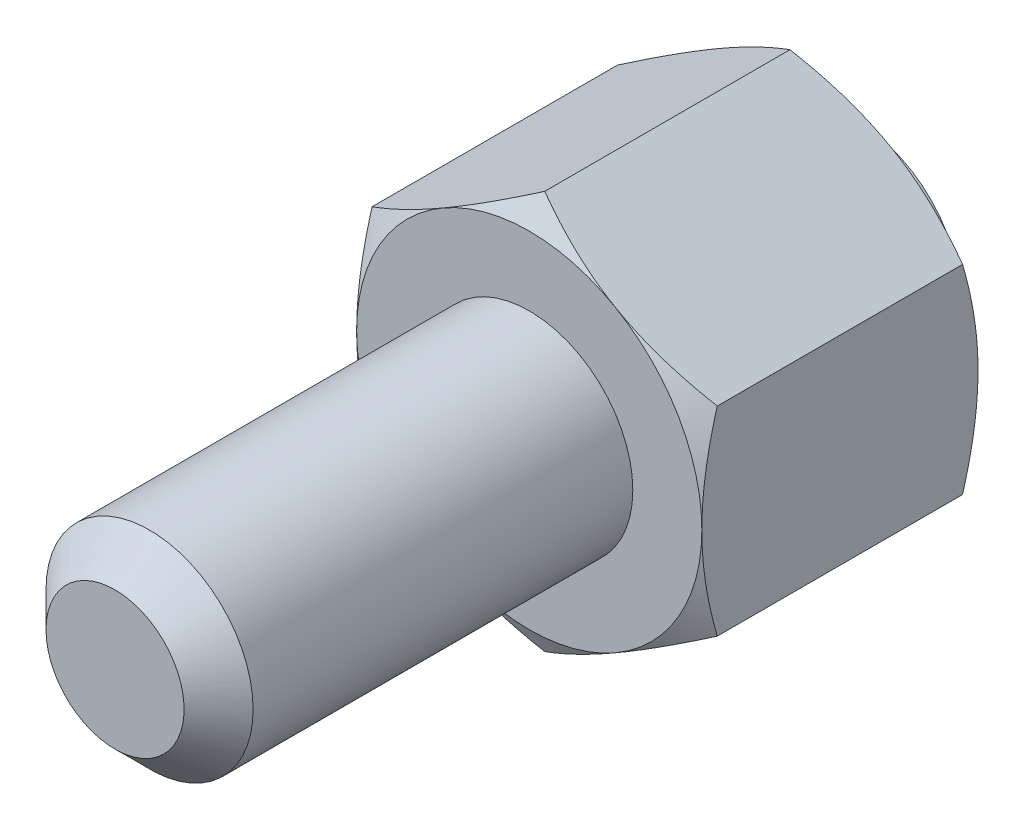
ISO-10303-21;
HEADER;
FILE_DESCRIPTION(('STEP AP214'),'2;1');
FILE_NAME('part.step','',(''),(''),'','','');
FILE_SCHEMA(('AUTOMOTIVE_DESIGN { 1 0 10303 214 1 1 1 1 }'));
ENDSEC;
DATA;
#1=APPLICATION_CONTEXT('core data for automotive mechanical design processes');
#2=APPLICATION_PROTOCOL_DEFINITION('international standard','automotive_design',2000,#1);
#3=PRODUCT_CONTEXT('',#1,'mechanical');
#4=PRODUCT('Part','Part','',(#3));
#5=PRODUCT_RELATED_PRODUCT_CATEGORY('part','',(#4));
#6=PRODUCT_DEFINITION_FORMATION('','',#4);
#7=PRODUCT_DEFINITION_CONTEXT('part definition',#1,'design');
#8=PRODUCT_DEFINITION('design','',#6,#7);
#9=PRODUCT_DEFINITION_SHAPE('','',#8);
#10=(LENGTH_UNIT() NAMED_UNIT(*) SI_UNIT(.MILLI.,.METRE.));
#11=(NAMED_UNIT(*) PLANE_ANGLE_UNIT() SI_UNIT($,.RADIAN.));
#12=(NAMED_UNIT(*) SI_UNIT($,.STERADIAN.) SOLID_ANGLE_UNIT());
#13=UNCERTAINTY_MEASURE_WITH_UNIT(LENGTH_MEASURE(1.E-05),#10,'distance_accuracy_value','');
#14=(GEOMETRIC_REPRESENTATION_CONTEXT(3) GLOBAL_UNCERTAINTY_ASSIGNED_CONTEXT((#13)) GLOBAL_UNIT_ASSIGNED_CONTEXT((#10,
#11,#12)) REPRESENTATION_CONTEXT('',''));
#15=CARTESIAN_POINT('',(0.,0.,0.));
#16=DIRECTION('',(0.,0.,1.));
#17=DIRECTION('',(1.,0.,0.));
#18=AXIS2_PLACEMENT_3D('',#15,#16,#17);
#19=CARTESIAN_POINT('',(0.,-5.77350269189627,11.5));
#20=DIRECTION('',(-0.500000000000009,0.866025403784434,0.));
#21=DIRECTION('',(0.866025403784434,0.500000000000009,0.));
#22=AXIS2_PLACEMENT_3D('',#19,#20,#21);
#23=PLANE('',#22);
#24=CARTESIAN_POINT('',(5.0002,-2.88663587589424,1.94664865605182));
#25=CARTESIAN_POINT('',(4.78046540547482,-3.01349970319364,1.87338656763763));
#26=CARTESIAN_POINT('',(4.55885141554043,-3.14144859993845,1.80675132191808));
#27=CARTESIAN_POINT('',(4.1117860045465,-3.39956193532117,1.6904389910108));
#28=CARTESIAN_POINT('',(3.88632664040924,-3.52973095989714,1.64080304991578));
#29=CARTESIAN_POINT('',(3.43816769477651,-3.78847564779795,1.56355102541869));
#30=CARTESIAN_POINT('',(3.21553790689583,-3.91701101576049,1.53542037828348));
#31=CARTESIAN_POINT('',(2.88081009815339,-4.1102662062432,1.51019492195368));
#32=CARTESIAN_POINT('',(2.76915780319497,-4.17472868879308,1.50461345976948));
#33=CARTESIAN_POINT('',(2.54575002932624,-4.30371322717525,1.49920221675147));
#34=CARTESIAN_POINT('',(2.43399455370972,-4.36823528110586,1.4993722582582));
#35=CARTESIAN_POINT('',(2.12781576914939,-4.54500768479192,1.50775363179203));
#36=CARTESIAN_POINT('',(1.93349391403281,-4.65719946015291,1.52182977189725));
#37=CARTESIAN_POINT('',(1.54613989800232,-4.88083840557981,1.56646525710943));
#38=CARTESIAN_POINT('',(1.35310909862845,-4.9922847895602,1.59703986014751));
#39=CARTESIAN_POINT('',(0.964974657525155,-5.21637431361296,1.67346849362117));
#40=CARTESIAN_POINT('',(0.76992000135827,-5.3289891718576,1.71964637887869));
#41=CARTESIAN_POINT('',(0.38271965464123,-5.55253939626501,1.82445179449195));
#42=CARTESIAN_POINT('',(0.190569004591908,-5.66347762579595,1.88305470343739));
#43=CARTESIAN_POINT('',(-0.000200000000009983,-5.77361816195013,1.94664865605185));
#44=B_SPLINE_CURVE_WITH_KNOTS('',3,(#24,#25,#26,#27,#28,#29,#30,#31,#32,#33,#34,#35,#36,#37,#38,
#39,#40,#41,#42,#43),.UNSPECIFIED.,.F.,.F.,(4,2,2,2,2,2,2,2,2,4),(0.,0.792555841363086,
1.58701660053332,2.36181537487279,2.74884076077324,3.13585419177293,3.80962362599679,
4.48401723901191,5.17336882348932,5.8613669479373),.UNSPECIFIED.);
#45=CARTESIAN_POINT('',(5.,-2.88675134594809,1.94658198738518));
#46=VERTEX_POINT('',#45);
#47=CARTESIAN_POINT('',(2.5,-4.3301270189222,1.5));
#48=VERTEX_POINT('',#47);
#49=EDGE_CURVE('E133',#46,#48,#44,.T.);
#50=ORIENTED_EDGE('',*,*,#49,.F.);
#51=DIRECTION('',(0.,0.,-1.));
#52=VECTOR('',#51,1.);
#53=CARTESIAN_POINT('',(5.,-2.88675134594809,11.5));
#54=LINE('',#53,#52);
#55=CARTESIAN_POINT('',(5.,-2.88675134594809,9.05341801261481));
#56=VERTEX_POINT('',#55);
#57=EDGE_CURVE('E292',#56,#46,#54,.T.);
#58=ORIENTED_EDGE('',*,*,#57,.F.);
#59=CARTESIAN_POINT('',(-0.00019999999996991,-5.77361816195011,9.05335134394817));
#60=CARTESIAN_POINT('',(0.219534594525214,-5.64675433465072,9.12661343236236));
#61=CARTESIAN_POINT('',(0.441148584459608,-5.5188054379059,9.1932486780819));
#62=CARTESIAN_POINT('',(0.888213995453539,-5.26069210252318,9.30956100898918));
#63=CARTESIAN_POINT('',(1.1136733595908,-5.13052307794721,9.35919695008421));
#64=CARTESIAN_POINT('',(1.56183230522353,-4.8717783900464,9.4364489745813));
#65=CARTESIAN_POINT('',(1.78446209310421,-4.74324302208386,9.46457962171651));
#66=CARTESIAN_POINT('',(2.11918990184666,-4.54998783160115,9.48980507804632));
#67=CARTESIAN_POINT('',(2.23084219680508,-4.48552534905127,9.49538654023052));
#68=CARTESIAN_POINT('',(2.45424997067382,-4.35654081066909,9.50079778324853));
#69=CARTESIAN_POINT('',(2.56600544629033,-4.29201875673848,9.5006277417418));
#70=CARTESIAN_POINT('',(2.87218423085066,-4.11524635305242,9.49224636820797));
#71=CARTESIAN_POINT('',(3.06650608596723,-4.00305457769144,9.47817022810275));
#72=CARTESIAN_POINT('',(3.45386010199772,-3.77941563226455,9.43353474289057));
#73=CARTESIAN_POINT('',(3.64689090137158,-3.66796924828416,9.4029601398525));
#74=CARTESIAN_POINT('',(4.03502534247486,-3.44387972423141,9.32653150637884));
#75=CARTESIAN_POINT('',(4.23007999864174,-3.33126486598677,9.28035362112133));
#76=CARTESIAN_POINT('',(4.61728034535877,-3.10771464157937,9.17554820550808));
#77=CARTESIAN_POINT('',(4.80943099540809,-2.99677641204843,9.11694529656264));
#78=CARTESIAN_POINT('',(5.0002,-2.88663587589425,9.05335134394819));
#79=B_SPLINE_CURVE_WITH_KNOTS('',3,(#59,#60,#61,#62,#63,#64,#65,#66,#67,#68,#69,#70,#71,#72,#73,
#74,#75,#76,#77,#78),.UNSPECIFIED.,.F.,.F.,(4,2,2,2,2,2,2,2,2,4),(0.,0.792555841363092,
1.58701660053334,2.36181537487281,2.74884076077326,3.13585419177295,3.8096236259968,
4.48401723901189,5.17336882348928,5.86136694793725),.UNSPECIFIED.);
#80=CARTESIAN_POINT('',(2.50000000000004,-4.33012701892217,9.5));
#81=VERTEX_POINT('',#80);
#82=EDGE_CURVE('E206',#81,#56,#79,.T.);
#83=ORIENTED_EDGE('',*,*,#82,.F.);
#84=CARTESIAN_POINT('',(0.,-5.77350269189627,9.0534180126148));
#85=VERTEX_POINT('',#84);
#86=EDGE_CURVE('E252',#85,#81,#79,.T.);
#87=ORIENTED_EDGE('',*,*,#86,.F.);
#88=DIRECTION('',(0.,0.,-1.));
#89=VECTOR('',#88,1.);
#90=CARTESIAN_POINT('',(0.,-5.77350269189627,11.5));
#91=LINE('',#90,#89);
#92=CARTESIAN_POINT('',(0.,-5.77350269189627,1.94658198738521));
#93=VERTEX_POINT('',#92);
#94=EDGE_CURVE('E287',#85,#93,#91,.T.);
#95=ORIENTED_EDGE('',*,*,#94,.T.);
#96=EDGE_CURVE('E38',#48,#93,#44,.T.);
#97=ORIENTED_EDGE('',*,*,#96,.F.);
#98=EDGE_LOOP('',(#50,#58,#83,#87,#95,#97));
#99=FACE_BOUND('',#98,.T.);
#100=ADVANCED_FACE('F14',(#99),#23,.F.);
#101=CARTESIAN_POINT('',(5.,-2.88675134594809,11.5));
#102=DIRECTION('',(-1.,0.,0.));
#103=DIRECTION('',(0.,0.,-1.));
#104=AXIS2_PLACEMENT_3D('',#101,#102,#103);
#105=PLANE('',#104);
#106=CARTESIAN_POINT('',(5.,-7.70744127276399,3.91748127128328));
#107=CARTESIAN_POINT('',(5.,-7.48944850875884,3.8119239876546));
#108=CARTESIAN_POINT('',(5.,-7.27095027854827,3.70739243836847));
#109=CARTESIAN_POINT('',(5.,-6.83267390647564,3.50095865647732));
#110=CARTESIAN_POINT('',(5.,-6.61289556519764,3.39905684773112));
#111=CARTESIAN_POINT('',(5.,-6.17063500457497,3.19793766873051));
#112=CARTESIAN_POINT('',(5.,-5.94814454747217,3.09873834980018));
#113=CARTESIAN_POINT('',(5.,-5.50137759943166,2.90446216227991));
#114=CARTESIAN_POINT('',(5.,-5.27710119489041,2.80938509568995));
#115=CARTESIAN_POINT('',(5.,-4.81934362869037,2.62154541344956));
#116=CARTESIAN_POINT('',(5.,-4.58579411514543,2.52894844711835));
#117=CARTESIAN_POINT('',(5.,-4.11594543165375,2.35087648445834));
#118=CARTESIAN_POINT('',(5.,-3.87964595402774,2.26540229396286));
#119=CARTESIAN_POINT('',(5.,-3.40437913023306,2.10385408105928));
#120=CARTESIAN_POINT('',(5.,-3.16541846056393,2.02776061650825));
#121=CARTESIAN_POINT('',(5.,-2.68406991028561,1.88744643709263));
#122=CARTESIAN_POINT('',(5.,-2.44168315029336,1.82322193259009));
#123=CARTESIAN_POINT('',(5.,-1.95468423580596,1.7100982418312));
#124=CARTESIAN_POINT('',(5.,-1.71009137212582,1.66111755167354));
#125=CARTESIAN_POINT('',(5.,-1.2179134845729,1.58128125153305));
#126=CARTESIAN_POINT('',(5.,-0.970328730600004,1.5504240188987));
#127=CARTESIAN_POINT('',(5.,-0.476617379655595,1.50970112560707));
#128=CARTESIAN_POINT('',(5.,-0.230513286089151,1.49956934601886));
#129=CARTESIAN_POINT('',(5.,0.26167501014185,1.50045868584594));
#130=CARTESIAN_POINT('',(5.,0.507759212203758,1.51148030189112));
#131=CARTESIAN_POINT('',(5.,0.926943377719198,1.54749890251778));
#132=CARTESIAN_POINT('',(5.,1.10049654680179,1.56751128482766));
#133=CARTESIAN_POINT('',(5.,1.44629389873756,1.61678599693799));
#134=CARTESIAN_POINT('',(5.,1.61853789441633,1.64604962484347));
#135=CARTESIAN_POINT('',(5.,2.13309893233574,1.74617515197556));
#136=CARTESIAN_POINT('',(5.,2.47304427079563,1.82935219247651));
#137=CARTESIAN_POINT('',(5.,2.98128183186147,1.97308911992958));
#138=CARTESIAN_POINT('',(5.,3.15222109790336,2.02481822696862));
#139=CARTESIAN_POINT('',(5.,3.49243829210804,2.1335258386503));
#140=CARTESIAN_POINT('',(5.,3.66171620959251,2.19050437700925));
#141=CARTESIAN_POINT('',(5.,3.99866665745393,2.30880682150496));
#142=CARTESIAN_POINT('',(5.,4.16633972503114,2.37012921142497));
#143=CARTESIAN_POINT('',(5.,4.50030514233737,2.4964102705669));
#144=CARTESIAN_POINT('',(5.,4.66659750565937,2.56136890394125));
#145=CARTESIAN_POINT('',(5.,5.04803367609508,2.71440889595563));
#146=CARTESIAN_POINT('',(5.,5.26275324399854,2.80354544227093));
#147=CARTESIAN_POINT('',(5.,5.69045278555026,2.9859093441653));
#148=CARTESIAN_POINT('',(5.,5.90343266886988,3.07913691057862));
#149=CARTESIAN_POINT('',(5.,6.32795935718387,3.26889080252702));
#150=CARTESIAN_POINT('',(5.,6.53950590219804,3.36541770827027));
#151=CARTESIAN_POINT('',(5.,6.96136313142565,3.56113912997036));
#152=CARTESIAN_POINT('',(5.,7.17167379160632,3.66033369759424));
#153=CARTESIAN_POINT('',(5.,7.80142682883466,3.96134775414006));
#154=CARTESIAN_POINT('',(5.,8.21931083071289,4.16642577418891));
#155=CARTESIAN_POINT('',(5.,9.05210217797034,4.5825381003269));
#156=CARTESIAN_POINT('',(5.,9.46700942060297,4.79357261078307));
#157=CARTESIAN_POINT('',(5.,10.0712479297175,5.10485123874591));
#158=CARTESIAN_POINT('',(5.,10.2614503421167,5.20340928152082));
#159=CARTESIAN_POINT('',(5.,10.6414400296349,5.40131443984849));
#160=CARTESIAN_POINT('',(5.,10.8312273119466,5.50066154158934));
#161=CARTESIAN_POINT('',(5.,11.4000634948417,5.799737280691));
#162=CARTESIAN_POINT('',(5.,11.7785724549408,6.00049297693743));
#163=CARTESIAN_POINT('',(5.,12.5336033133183,6.40364018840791));
#164=CARTESIAN_POINT('',(5.,12.9101277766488,6.6060269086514));
#165=CARTESIAN_POINT('',(5.,13.6622573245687,7.01245675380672));
#166=CARTESIAN_POINT('',(5.,14.0378624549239,7.21649979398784));
#167=CARTESIAN_POINT('',(5.,14.4131258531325,7.42116548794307));
#168=B_SPLINE_CURVE_WITH_KNOTS('',3,(#106,#107,#108,#109,#110,#111,#112,#113,#114,#115,#116,
#117,#118,#119,#120,#121,#122,#123,#124,#125,#126,#127,#128,#129,#130,#131,#132,#133,#134,#135,
#136,#137,#138,#139,#140,#141,#142,#143,#144,#145,#146,#147,#148,#149,#150,#151,#152,#153,#154,
#155,#156,#157,#158,#159,#160,#161,#162,#163,#164,#165,#166,#167),.UNSPECIFIED.,.F.,.F.,(4,2,2,
2,2,2,2,2,2,2,2,2,2,2,2,2,2,2,2,2,2,2,2,2,2,2,2,2,2,2,4),(0.,0.726623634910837,1.45336366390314,
2.18413973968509,2.91488067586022,3.66849919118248,4.42220285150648,5.17431717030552,
5.92619093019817,6.67397270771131,7.42168752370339,8.15973969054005,8.89780918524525,
9.42166361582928,9.9455915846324,10.9940498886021,11.5297908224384,12.0655351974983,
12.6010934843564,13.1366464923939,13.8340490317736,14.5314875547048,15.229049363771,
15.9266246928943,17.3230246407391,18.7194725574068,19.3621341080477,20.0047844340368,
21.2901332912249,22.5725406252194,23.8548827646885),.UNSPECIFIED.);
#169=CARTESIAN_POINT('',(5.,2.88675134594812,1.94658198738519));
#170=VERTEX_POINT('',#169);
#171=CARTESIAN_POINT('',(5.,0.,1.5));
#172=VERTEX_POINT('',#171);
#173=EDGE_CURVE('E313',#170,#172,#168,.F.);
#174=ORIENTED_EDGE('',*,*,#173,.F.);
#175=DIRECTION('',(0.,0.,-1.));
#176=VECTOR('',#175,1.);
#177=CARTESIAN_POINT('',(5.,2.88675134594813,11.5));
#178=LINE('',#177,#176);
#179=CARTESIAN_POINT('',(5.,2.88675134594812,9.05341801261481));
#180=VERTEX_POINT('',#179);
#181=EDGE_CURVE('E284',#180,#170,#178,.T.);
#182=ORIENTED_EDGE('',*,*,#181,.F.);
#183=CARTESIAN_POINT('',(5.,-7.74883329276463,7.06245429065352));
#184=CARTESIAN_POINT('',(5.,-7.53049946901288,7.16834431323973));
#185=CARTESIAN_POINT('',(5.,-7.31166387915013,7.27321749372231));
#186=CARTESIAN_POINT('',(5.,-6.8727223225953,7.4803581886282));
#187=CARTESIAN_POINT('',(5.,-6.65261616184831,7.58262529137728));
#188=CARTESIAN_POINT('',(5.,-6.20972996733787,7.78449751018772));
#189=CARTESIAN_POINT('',(5.,-5.98694189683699,7.88408505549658));
#190=CARTESIAN_POINT('',(5.,-5.53959195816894,8.07917770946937));
#191=CARTESIAN_POINT('',(5.,-5.31503017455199,8.17468301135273));
#192=CARTESIAN_POINT('',(5.,-4.85653860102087,8.36351388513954));
#193=CARTESIAN_POINT('',(5.,-4.62253924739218,8.45667147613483));
#194=CARTESIAN_POINT('',(5.,-4.15180084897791,8.63592319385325));
#195=CARTESIAN_POINT('',(5.,-3.9150614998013,8.72201652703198));
#196=CARTESIAN_POINT('',(5.,-3.43891142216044,8.88487567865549));
#197=CARTESIAN_POINT('',(5.,-3.19950723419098,8.96166042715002));
#198=CARTESIAN_POINT('',(5.,-2.71726462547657,9.1034348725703));
#199=CARTESIAN_POINT('',(5.,-2.47442731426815,9.16842829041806));
#200=CARTESIAN_POINT('',(5.,-1.98653288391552,9.28315054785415));
#201=CARTESIAN_POINT('',(5.,-1.74149561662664,9.33296225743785));
#202=CARTESIAN_POINT('',(5.,-1.24837916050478,9.41450383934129));
#203=CARTESIAN_POINT('',(5.,-1.00030025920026,9.44623540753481));
#204=CARTESIAN_POINT('',(5.,-0.505577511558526,9.48866997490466));
#205=CARTESIAN_POINT('',(5.,-0.25895739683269,9.49964283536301));
#206=CARTESIAN_POINT('',(5.,0.234332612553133,9.50033965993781));
#207=CARTESIAN_POINT('',(5.,0.481002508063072,9.49006322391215));
#208=CARTESIAN_POINT('',(5.,0.899937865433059,9.45529080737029));
#209=CARTESIAN_POINT('',(5.,1.07265207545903,9.43589361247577));
#210=CARTESIAN_POINT('',(5.,1.41680507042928,9.3878920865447));
#211=CARTESIAN_POINT('',(5.,1.58824367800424,9.35928649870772));
#212=CARTESIAN_POINT('',(5.,2.10042470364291,9.26116179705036));
#213=CARTESIAN_POINT('',(5.,2.43883828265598,9.17935298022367));
#214=CARTESIAN_POINT('',(5.,2.94483676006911,9.03763933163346));
#215=CARTESIAN_POINT('',(5.,3.11504848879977,8.98658079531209));
#216=CARTESIAN_POINT('',(5.,3.45381823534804,8.87919651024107));
#217=CARTESIAN_POINT('',(5.,3.62237624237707,8.8228707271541));
#218=CARTESIAN_POINT('',(5.,3.95789251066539,8.70585282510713));
#219=CARTESIAN_POINT('',(5.,4.12485128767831,8.64516217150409));
#220=CARTESIAN_POINT('',(5.,4.45738812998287,8.52012492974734));
#221=CARTESIAN_POINT('',(5.,4.62296621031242,8.45577838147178));
#222=CARTESIAN_POINT('',(5.,5.00898021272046,8.30164185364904));
#223=CARTESIAN_POINT('',(5.,5.22893065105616,8.21063840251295));
#224=CARTESIAN_POINT('',(5.,5.66699461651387,8.02430103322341));
#225=CARTESIAN_POINT('',(5.,5.88510803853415,7.92896686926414));
#226=CARTESIAN_POINT('',(5.,6.31982994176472,7.73482468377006));
#227=CARTESIAN_POINT('',(5.,6.53643812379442,7.63601599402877));
#228=CARTESIAN_POINT('',(5.,6.96835984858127,7.43560426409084));
#229=CARTESIAN_POINT('',(5.,7.18367336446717,7.33400116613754));
#230=CARTESIAN_POINT('',(5.,7.82840184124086,7.02560744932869));
#231=CARTESIAN_POINT('',(5.,8.25619086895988,6.81541977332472));
#232=CARTESIAN_POINT('',(5.,9.10868695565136,6.3888855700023));
#233=CARTESIAN_POINT('',(5.,9.53339390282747,6.17253882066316));
#234=CARTESIAN_POINT('',(5.,10.1513439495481,5.85370074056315));
#235=CARTESIAN_POINT('',(5.,10.3454851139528,5.75294487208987));
#236=CARTESIAN_POINT('',(5.,10.7333432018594,5.55062830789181));
#237=CARTESIAN_POINT('',(5.,10.9270601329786,5.44906762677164));
#238=CARTESIAN_POINT('',(5.,11.5076762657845,5.14333198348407));
#239=CARTESIAN_POINT('',(5.,11.8940250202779,4.93811158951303));
#240=CARTESIAN_POINT('',(5.,12.6646488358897,4.52604252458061));
#241=CARTESIAN_POINT('',(5.,13.048926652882,4.3191989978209));
#242=CARTESIAN_POINT('',(5.,13.8165498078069,3.90383718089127));
#243=CARTESIAN_POINT('',(5.,14.199895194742,3.6953189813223));
#244=CARTESIAN_POINT('',(5.,14.5828959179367,3.48617358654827));
#245=B_SPLINE_CURVE_WITH_KNOTS('',3,(#183,#184,#185,#186,#187,#188,#189,#190,#191,#192,#193,
#194,#195,#196,#197,#198,#199,#200,#201,#202,#203,#204,#205,#206,#207,#208,#209,#210,#211,#212,
#213,#214,#215,#216,#217,#218,#219,#220,#221,#222,#223,#224,#225,#226,#227,#228,#229,#230,#231,
#232,#233,#234,#235,#236,#237,#238,#239,#240,#241,#242,#243,#244),.UNSPECIFIED.,.F.,.F.,(4,2,2,
2,2,2,2,2,2,2,2,2,2,2,2,2,2,2,2,2,2,2,2,2,2,2,2,2,2,2,4),(0.,0.727979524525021,1.45607334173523,
2.18814015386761,2.92017227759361,3.67566755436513,4.43124758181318,5.18526431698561,
5.93904269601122,6.68862964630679,7.43814627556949,8.17785045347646,8.91756856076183,
9.4387156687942,9.95993393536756,11.002952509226,11.5360222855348,12.0690955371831,
12.6019906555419,13.1348799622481,13.8489176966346,14.5629960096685,15.2772124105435,
15.9914435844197,17.4212685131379,18.8511450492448,19.5073316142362,20.1635062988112,
21.475908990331,22.7851347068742,24.0942900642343),.UNSPECIFIED.);
#246=CARTESIAN_POINT('',(5.,0.,9.5));
#247=VERTEX_POINT('',#246);
#248=EDGE_CURVE('E215',#247,#180,#245,.T.);
#249=ORIENTED_EDGE('',*,*,#248,.F.);
#250=EDGE_CURVE('E331',#56,#247,#245,.T.);
#251=ORIENTED_EDGE('',*,*,#250,.F.);
#252=ORIENTED_EDGE('',*,*,#57,.T.);
#253=EDGE_CURVE('E181',#172,#46,#168,.F.);
#254=ORIENTED_EDGE('',*,*,#253,.F.);
#255=EDGE_LOOP('',(#174,#182,#249,#251,#252,#254));
#256=FACE_BOUND('',#255,.T.);
#257=ADVANCED_FACE('F191',(#256),#105,.F.);
#258=CARTESIAN_POINT('',(0.,5.77350269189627,11.5));
#259=DIRECTION('',(0.5,0.866025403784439,0.));
#260=DIRECTION('',(0.866025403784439,-0.5,0.));
#261=AXIS2_PLACEMENT_3D('',#258,#259,#260);
#262=PLANE('',#261);
#263=ORIENTED_EDGE('',*,*,#181,.T.);
#264=CARTESIAN_POINT('',(5.0002,2.88663587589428,1.94664865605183));
#265=CARTESIAN_POINT('',(4.78046540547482,3.01349970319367,1.87338656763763));
#266=CARTESIAN_POINT('',(4.55885141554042,3.14144859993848,1.80675132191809));
#267=CARTESIAN_POINT('',(4.11178600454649,3.3995619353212,1.69043899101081));
#268=CARTESIAN_POINT('',(3.88632664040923,3.52973095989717,1.64080304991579));
#269=CARTESIAN_POINT('',(3.43816769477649,3.78847564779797,1.5635510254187));
#270=CARTESIAN_POINT('',(3.21553790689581,3.91701101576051,1.53542037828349));
#271=CARTESIAN_POINT('',(2.88081009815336,4.11026620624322,1.51019492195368));
#272=CARTESIAN_POINT('',(2.76915780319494,4.1747286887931,1.50461345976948));
#273=CARTESIAN_POINT('',(2.54575002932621,4.30371322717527,1.49920221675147));
#274=CARTESIAN_POINT('',(2.43399455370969,4.36823528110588,1.4993722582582));
#275=CARTESIAN_POINT('',(2.12781576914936,4.54500768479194,1.50775363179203));
#276=CARTESIAN_POINT('',(1.93349391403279,4.65719946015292,1.52182977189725));
#277=CARTESIAN_POINT('',(1.54613989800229,4.88083840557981,1.56646525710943));
#278=CARTESIAN_POINT('',(1.35310909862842,4.9922847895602,1.59703986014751));
#279=CARTESIAN_POINT('',(0.96497465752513,5.21637431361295,1.67346849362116));
#280=CARTESIAN_POINT('',(0.769920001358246,5.32898917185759,1.71964637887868));
#281=CARTESIAN_POINT('',(0.382719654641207,5.55253939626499,1.82445179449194));
#282=CARTESIAN_POINT('',(0.190569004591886,5.66347762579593,1.88305470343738));
#283=CARTESIAN_POINT('',(-0.000200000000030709,5.77361816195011,1.94664865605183));
#284=B_SPLINE_CURVE_WITH_KNOTS('',3,(#264,#265,#266,#267,#268,#269,#270,#271,#272,#273,#274,
#275,#276,#277,#278,#279,#280,#281,#282,#283),.UNSPECIFIED.,.F.,.F.,(4,2,2,2,2,2,2,2,2,4),(0.,
0.792555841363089,1.58701660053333,2.3618153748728,2.74884076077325,3.13585419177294,
3.8096236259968,4.48401723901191,5.17336882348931,5.86136694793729),.UNSPECIFIED.);
#285=CARTESIAN_POINT('',(2.5,4.33012701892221,1.5));
#286=VERTEX_POINT('',#285);
#287=EDGE_CURVE('E134',#170,#286,#284,.T.);
#288=ORIENTED_EDGE('',*,*,#287,.T.);
#289=CARTESIAN_POINT('',(0.,5.77350269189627,1.94658198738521));
#290=VERTEX_POINT('',#289);
#291=EDGE_CURVE('E117',#286,#290,#284,.T.);
#292=ORIENTED_EDGE('',*,*,#291,.T.);
#293=DIRECTION('',(0.,0.,-1.));
#294=VECTOR('',#293,1.);
#295=CARTESIAN_POINT('',(0.,5.77350269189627,11.5));
#296=LINE('',#295,#294);
#297=CARTESIAN_POINT('',(0.,5.77350269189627,9.0534180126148));
#298=VERTEX_POINT('',#297);
#299=EDGE_CURVE('E132',#298,#290,#296,.T.);
#300=ORIENTED_EDGE('',*,*,#299,.F.);
#301=CARTESIAN_POINT('',(-0.000200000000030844,5.77361816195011,9.05335134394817));
#302=CARTESIAN_POINT('',(0.219534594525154,5.64675433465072,9.12661343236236));
#303=CARTESIAN_POINT('',(0.44114858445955,5.51880543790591,9.1932486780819));
#304=CARTESIAN_POINT('',(0.888213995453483,5.26069210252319,9.30956100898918));
#305=CARTESIAN_POINT('',(1.11367335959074,5.13052307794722,9.35919695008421));
#306=CARTESIAN_POINT('',(1.56183230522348,4.87177839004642,9.4364489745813));
#307=CARTESIAN_POINT('',(1.78446209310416,4.74324302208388,9.46457962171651));
#308=CARTESIAN_POINT('',(2.11918990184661,4.54998783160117,9.48980507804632));
#309=CARTESIAN_POINT('',(2.23084219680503,4.48552534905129,9.49538654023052));
#310=CARTESIAN_POINT('',(2.45424997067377,4.35654081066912,9.50079778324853));
#311=CARTESIAN_POINT('',(2.56600544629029,4.29201875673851,9.5006277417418));
#312=CARTESIAN_POINT('',(2.87218423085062,4.11524635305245,9.49224636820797));
#313=CARTESIAN_POINT('',(3.06650608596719,4.00305457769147,9.47817022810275));
#314=CARTESIAN_POINT('',(3.45386010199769,3.77941563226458,9.43353474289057));
#315=CARTESIAN_POINT('',(3.64689090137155,3.66796924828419,9.4029601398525));
#316=CARTESIAN_POINT('',(4.03502534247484,3.44387972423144,9.32653150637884));
#317=CARTESIAN_POINT('',(4.23007999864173,3.3312648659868,9.28035362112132));
#318=CARTESIAN_POINT('',(4.61728034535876,3.1077146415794,9.17554820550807));
#319=CARTESIAN_POINT('',(4.80943099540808,2.99677641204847,9.11694529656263));
#320=CARTESIAN_POINT('',(5.0002,2.88663587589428,9.05335134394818));
#321=B_SPLINE_CURVE_WITH_KNOTS('',3,(#301,#302,#303,#304,#305,#306,#307,#308,#309,#310,#311,
#312,#313,#314,#315,#316,#317,#318,#319,#320),.UNSPECIFIED.,.F.,.F.,(4,2,2,2,2,2,2,2,2,4),(0.,
0.792555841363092,1.58701660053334,2.36181537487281,2.74884076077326,3.13585419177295,
3.8096236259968,4.48401723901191,5.17336882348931,5.86136694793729),.UNSPECIFIED.);
#322=CARTESIAN_POINT('',(2.5,4.33012701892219,9.5));
#323=VERTEX_POINT('',#322);
#324=EDGE_CURVE('E197',#298,#323,#321,.T.);
#325=ORIENTED_EDGE('',*,*,#324,.T.);
#326=EDGE_CURVE('E208',#323,#180,#321,.T.);
#327=ORIENTED_EDGE('',*,*,#326,.T.);
#328=EDGE_LOOP('',(#263,#288,#292,#300,#325,#327));
#329=FACE_BOUND('',#328,.T.);
#330=ADVANCED_FACE('F188',(#329),#262,.T.);
#331=CARTESIAN_POINT('',(0.,5.77350269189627,11.5));
#332=DIRECTION('',(0.500000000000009,-0.866025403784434,0.));
#333=DIRECTION('',(-0.866025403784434,-0.500000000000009,0.));
#334=AXIS2_PLACEMENT_3D('',#331,#332,#333);
#335=PLANE('',#334);
#336=CARTESIAN_POINT('',(-5.0002,2.88663587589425,1.94664865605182));
#337=CARTESIAN_POINT('',(-4.78046540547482,3.01349970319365,1.87338656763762));
#338=CARTESIAN_POINT('',(-4.55885141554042,3.14144859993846,1.80675132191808));
#339=CARTESIAN_POINT('',(-4.11178600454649,3.39956193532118,1.6904389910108));
#340=CARTESIAN_POINT('',(-3.88632664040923,3.52973095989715,1.64080304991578));
#341=CARTESIAN_POINT('',(-3.4381676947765,3.78847564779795,1.56355102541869));
#342=CARTESIAN_POINT('',(-3.21553790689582,3.9170110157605,1.53542037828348));
#343=CARTESIAN_POINT('',(-2.88081009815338,4.1102662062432,1.51019492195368));
#344=CARTESIAN_POINT('',(-2.76915780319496,4.17472868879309,1.50461345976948));
#345=CARTESIAN_POINT('',(-2.54575002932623,4.30371322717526,1.49920221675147));
#346=CARTESIAN_POINT('',(-2.43399455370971,4.36823528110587,1.4993722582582));
#347=CARTESIAN_POINT('',(-2.12781576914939,4.54500768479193,1.50775363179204));
#348=CARTESIAN_POINT('',(-1.93349391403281,4.65719946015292,1.52182977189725));
#349=CARTESIAN_POINT('',(-1.54613989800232,4.88083840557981,1.56646525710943));
#350=CARTESIAN_POINT('',(-1.35310909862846,4.9922847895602,1.59703986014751));
#351=CARTESIAN_POINT('',(-0.964974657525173,5.21637431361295,1.67346849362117));
#352=CARTESIAN_POINT('',(-0.769920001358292,5.32898917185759,1.71964637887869));
#353=CARTESIAN_POINT('',(-0.382719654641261,5.55253939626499,1.82445179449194));
#354=CARTESIAN_POINT('',(-0.190569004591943,5.66347762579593,1.88305470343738));
#355=CARTESIAN_POINT('',(0.00019999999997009,5.77361816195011,1.94664865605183));
#356=B_SPLINE_CURVE_WITH_KNOTS('',3,(#336,#337,#338,#339,#340,#341,#342,#343,#344,#345,#346,
#347,#348,#349,#350,#351,#352,#353,#354,#355),.UNSPECIFIED.,.F.,.F.,(4,2,2,2,2,2,2,2,2,4),(0.,
0.792555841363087,1.58701660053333,2.3618153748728,2.74884076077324,3.13585419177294,
3.80962362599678,4.48401723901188,5.17336882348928,5.86136694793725),.UNSPECIFIED.);
#357=CARTESIAN_POINT('',(-5.,2.8867513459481,1.94658198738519));
#358=VERTEX_POINT('',#357);
#359=CARTESIAN_POINT('',(-2.5,4.3301270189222,1.5));
#360=VERTEX_POINT('',#359);
#361=EDGE_CURVE('E103',#358,#360,#356,.T.);
#362=ORIENTED_EDGE('',*,*,#361,.F.);
#363=DIRECTION('',(0.,0.,-1.));
#364=VECTOR('',#363,1.);
#365=CARTESIAN_POINT('',(-5.,2.8867513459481,11.5));
#366=LINE('',#365,#364);
#367=CARTESIAN_POINT('',(-5.,2.8867513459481,9.05341801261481));
#368=VERTEX_POINT('',#367);
#369=EDGE_CURVE('E277',#368,#358,#366,.T.);
#370=ORIENTED_EDGE('',*,*,#369,.F.);
#371=CARTESIAN_POINT('',(0.00019999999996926,5.77361816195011,9.05335134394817));
#372=CARTESIAN_POINT('',(-0.219534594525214,5.64675433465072,9.12661343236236));
#373=CARTESIAN_POINT('',(-0.441148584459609,5.5188054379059,9.1932486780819));
#374=CARTESIAN_POINT('',(-0.88821399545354,5.26069210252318,9.30956100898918));
#375=CARTESIAN_POINT('',(-1.1136733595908,5.13052307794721,9.35919695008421));
#376=CARTESIAN_POINT('',(-1.56183230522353,4.8717783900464,9.4364489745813));
#377=CARTESIAN_POINT('',(-1.78446209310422,4.74324302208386,9.46457962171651));
#378=CARTESIAN_POINT('',(-2.11918990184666,4.54998783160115,9.48980507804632));
#379=CARTESIAN_POINT('',(-2.23084219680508,4.48552534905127,9.49538654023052));
#380=CARTESIAN_POINT('',(-2.45424997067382,4.35654081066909,9.50079778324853));
#381=CARTESIAN_POINT('',(-2.56600544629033,4.29201875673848,9.5006277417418));
#382=CARTESIAN_POINT('',(-2.87218423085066,4.11524635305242,9.49224636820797));
#383=CARTESIAN_POINT('',(-3.06650608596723,4.00305457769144,9.47817022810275));
#384=CARTESIAN_POINT('',(-3.45386010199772,3.77941563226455,9.43353474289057));
#385=CARTESIAN_POINT('',(-3.64689090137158,3.66796924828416,9.4029601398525));
#386=CARTESIAN_POINT('',(-4.03502534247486,3.44387972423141,9.32653150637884));
#387=CARTESIAN_POINT('',(-4.23007999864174,3.33126486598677,9.28035362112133));
#388=CARTESIAN_POINT('',(-4.61728034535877,3.10771464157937,9.17554820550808));
#389=CARTESIAN_POINT('',(-4.80943099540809,2.99677641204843,9.11694529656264));
#390=CARTESIAN_POINT('',(-5.0002,2.88663587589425,9.05335134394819));
#391=B_SPLINE_CURVE_WITH_KNOTS('',3,(#371,#372,#373,#374,#375,#376,#377,#378,#379,#380,#381,
#382,#383,#384,#385,#386,#387,#388,#389,#390),.UNSPECIFIED.,.F.,.F.,(4,2,2,2,2,2,2,2,2,4),(0.,
0.792555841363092,1.58701660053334,2.36181537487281,2.74884076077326,3.13585419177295,
3.80962362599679,4.48401723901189,5.17336882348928,5.86136694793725),.UNSPECIFIED.);
#392=CARTESIAN_POINT('',(-2.50000000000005,4.33012701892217,9.5));
#393=VERTEX_POINT('',#392);
#394=EDGE_CURVE('E209',#393,#368,#391,.T.);
#395=ORIENTED_EDGE('',*,*,#394,.F.);
#396=EDGE_CURVE('E207',#298,#393,#391,.T.);
#397=ORIENTED_EDGE('',*,*,#396,.F.);
#398=ORIENTED_EDGE('',*,*,#299,.T.);
#399=EDGE_CURVE('E113',#360,#290,#356,.T.);
#400=ORIENTED_EDGE('',*,*,#399,.F.);
#401=EDGE_LOOP('',(#362,#370,#395,#397,#398,#400));
#402=FACE_BOUND('',#401,.T.);
#403=ADVANCED_FACE('F129',(#402),#335,.F.);
#404=CARTESIAN_POINT('',(-5.,-2.88675134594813,11.5));
#405=DIRECTION('',(-1.,0.,0.));
#406=DIRECTION('',(0.,0.,-1.));
#407=AXIS2_PLACEMENT_3D('',#404,#405,#406);
#408=PLANE('',#407);
#409=ORIENTED_EDGE('',*,*,#369,.T.);
#410=CARTESIAN_POINT('',(-5.,-7.70744127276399,3.91748127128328));
#411=CARTESIAN_POINT('',(-5.,-7.48944850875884,3.8119239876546));
#412=CARTESIAN_POINT('',(-5.,-7.27095027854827,3.70739243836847));
#413=CARTESIAN_POINT('',(-5.,-6.83267390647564,3.50095865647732));
#414=CARTESIAN_POINT('',(-5.,-6.61289556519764,3.39905684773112));
#415=CARTESIAN_POINT('',(-5.,-6.17063500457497,3.19793766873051));
#416=CARTESIAN_POINT('',(-5.,-5.94814454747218,3.09873834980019));
#417=CARTESIAN_POINT('',(-5.,-5.50137759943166,2.90446216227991));
#418=CARTESIAN_POINT('',(-5.,-5.27710119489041,2.80938509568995));
#419=CARTESIAN_POINT('',(-5.,-4.81934362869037,2.62154541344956));
#420=CARTESIAN_POINT('',(-5.,-4.58579411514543,2.52894844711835));
#421=CARTESIAN_POINT('',(-5.,-4.11594543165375,2.35087648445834));
#422=CARTESIAN_POINT('',(-5.,-3.87964595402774,2.26540229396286));
#423=CARTESIAN_POINT('',(-5.,-3.40437913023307,2.10385408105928));
#424=CARTESIAN_POINT('',(-5.,-3.16541846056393,2.02776061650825));
#425=CARTESIAN_POINT('',(-5.,-2.68406991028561,1.88744643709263));
#426=CARTESIAN_POINT('',(-5.,-2.44168315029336,1.82322193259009));
#427=CARTESIAN_POINT('',(-5.,-1.95468423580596,1.7100982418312));
#428=CARTESIAN_POINT('',(-5.,-1.71009137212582,1.66111755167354));
#429=CARTESIAN_POINT('',(-5.,-1.2179134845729,1.58128125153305));
#430=CARTESIAN_POINT('',(-5.,-0.970328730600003,1.5504240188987));
#431=CARTESIAN_POINT('',(-5.,-0.476617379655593,1.50970112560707));
#432=CARTESIAN_POINT('',(-5.,-0.23051328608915,1.49956934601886));
#433=CARTESIAN_POINT('',(-5.,0.261675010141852,1.50045868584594));
#434=CARTESIAN_POINT('',(-5.,0.50775921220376,1.51148030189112));
#435=CARTESIAN_POINT('',(-5.,0.926943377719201,1.54749890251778));
#436=CARTESIAN_POINT('',(-5.,1.10049654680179,1.56751128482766));
#437=CARTESIAN_POINT('',(-5.,1.44629389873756,1.61678599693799));
#438=CARTESIAN_POINT('',(-5.,1.61853789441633,1.64604962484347));
#439=CARTESIAN_POINT('',(-5.,2.13309893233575,1.74617515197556));
#440=CARTESIAN_POINT('',(-5.,2.47304427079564,1.82935219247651));
#441=CARTESIAN_POINT('',(-5.,2.98128183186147,1.97308911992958));
#442=CARTESIAN_POINT('',(-5.,3.15222109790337,2.02481822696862));
#443=CARTESIAN_POINT('',(-5.,3.49243829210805,2.1335258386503));
#444=CARTESIAN_POINT('',(-5.,3.66171620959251,2.19050437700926));
#445=CARTESIAN_POINT('',(-5.,3.99866665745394,2.30880682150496));
#446=CARTESIAN_POINT('',(-5.,4.16633972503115,2.37012921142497));
#447=CARTESIAN_POINT('',(-5.,4.50030514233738,2.4964102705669));
#448=CARTESIAN_POINT('',(-5.,4.66659750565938,2.56136890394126));
#449=CARTESIAN_POINT('',(-5.,5.04803367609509,2.71440889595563));
#450=CARTESIAN_POINT('',(-5.,5.26275324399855,2.80354544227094));
#451=CARTESIAN_POINT('',(-5.,5.69045278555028,2.9859093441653));
#452=CARTESIAN_POINT('',(-5.,5.90343266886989,3.07913691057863));
#453=CARTESIAN_POINT('',(-5.,6.32795935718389,3.26889080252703));
#454=CARTESIAN_POINT('',(-5.,6.53950590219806,3.36541770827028));
#455=CARTESIAN_POINT('',(-5.,6.96136313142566,3.56113912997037));
#456=CARTESIAN_POINT('',(-5.,7.17167379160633,3.66033369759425));
#457=CARTESIAN_POINT('',(-5.,7.80142682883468,3.96134775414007));
#458=CARTESIAN_POINT('',(-5.,8.21931083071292,4.16642577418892));
#459=CARTESIAN_POINT('',(-5.,9.05210217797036,4.58253810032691));
#460=CARTESIAN_POINT('',(-5.,9.46700942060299,4.79357261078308));
#461=CARTESIAN_POINT('',(-5.,10.0712479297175,5.10485123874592));
#462=CARTESIAN_POINT('',(-5.,10.2614503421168,5.20340928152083));
#463=CARTESIAN_POINT('',(-5.,10.641440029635,5.4013144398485));
#464=CARTESIAN_POINT('',(-5.,10.8312273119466,5.50066154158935));
#465=CARTESIAN_POINT('',(-5.,11.4000634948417,5.79973728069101));
#466=CARTESIAN_POINT('',(-5.,11.7785724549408,6.00049297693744));
#467=CARTESIAN_POINT('',(-5.,12.5336033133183,6.40364018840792));
#468=CARTESIAN_POINT('',(-5.,12.9101277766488,6.60602690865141));
#469=CARTESIAN_POINT('',(-5.,13.6622573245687,7.01245675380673));
#470=CARTESIAN_POINT('',(-5.,14.0378624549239,7.21649979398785));
#471=CARTESIAN_POINT('',(-5.,14.4131258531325,7.42116548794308));
#472=B_SPLINE_CURVE_WITH_KNOTS('',3,(#410,#411,#412,#413,#414,#415,#416,#417,#418,#419,#420,
#421,#422,#423,#424,#425,#426,#427,#428,#429,#430,#431,#432,#433,#434,#435,#436,#437,#438,#439,
#440,#441,#442,#443,#444,#445,#446,#447,#448,#449,#450,#451,#452,#453,#454,#455,#456,#457,#458,
#459,#460,#461,#462,#463,#464,#465,#466,#467,#468,#469,#470,#471),.UNSPECIFIED.,.F.,.F.,(4,2,2,
2,2,2,2,2,2,2,2,2,2,2,2,2,2,2,2,2,2,2,2,2,2,2,2,2,2,2,4),(0.,0.726623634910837,1.45336366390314,
2.18413973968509,2.91488067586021,3.66849919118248,4.42220285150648,5.17431717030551,
5.92619093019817,6.67397270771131,7.42168752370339,8.15973969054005,8.89780918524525,
9.42166361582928,9.9455915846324,10.9940498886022,11.5297908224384,12.0655351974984,
12.6010934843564,13.1366464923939,13.8340490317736,14.5314875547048,15.229049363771,
15.9266246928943,17.3230246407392,18.7194725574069,19.3621341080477,20.0047844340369,
21.290133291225,22.5725406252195,23.8548827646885),.UNSPECIFIED.);
#473=CARTESIAN_POINT('',(-5.,0.,1.5));
#474=VERTEX_POINT('',#473);
#475=EDGE_CURVE('E107',#358,#474,#472,.F.);
#476=ORIENTED_EDGE('',*,*,#475,.T.);
#477=CARTESIAN_POINT('',(-5.,-2.88675134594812,1.94658198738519));
#478=VERTEX_POINT('',#477);
#479=EDGE_CURVE('E144',#474,#478,#472,.F.);
#480=ORIENTED_EDGE('',*,*,#479,.T.);
#481=DIRECTION('',(0.,0.,-1.));
#482=VECTOR('',#481,1.);
#483=CARTESIAN_POINT('',(-5.,-2.88675134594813,11.5));
#484=LINE('',#483,#482);
#485=CARTESIAN_POINT('',(-5.,-2.88675134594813,9.0534180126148));
#486=VERTEX_POINT('',#485);
#487=EDGE_CURVE('E282',#486,#478,#484,.T.);
#488=ORIENTED_EDGE('',*,*,#487,.F.);
#489=CARTESIAN_POINT('',(-5.,-7.74883329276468,7.0624542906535));
#490=CARTESIAN_POINT('',(-5.,-7.53049946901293,7.1683443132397));
#491=CARTESIAN_POINT('',(-5.,-7.31166387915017,7.27321749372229));
#492=CARTESIAN_POINT('',(-5.,-6.87272232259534,7.48035818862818));
#493=CARTESIAN_POINT('',(-5.,-6.65261616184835,7.58262529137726));
#494=CARTESIAN_POINT('',(-5.,-6.20972996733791,7.7844975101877));
#495=CARTESIAN_POINT('',(-5.,-5.98694189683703,7.88408505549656));
#496=CARTESIAN_POINT('',(-5.,-5.53959195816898,8.07917770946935));
#497=CARTESIAN_POINT('',(-5.,-5.31503017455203,8.17468301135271));
#498=CARTESIAN_POINT('',(-5.,-4.85653860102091,8.36351388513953));
#499=CARTESIAN_POINT('',(-5.,-4.62253924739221,8.45667147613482));
#500=CARTESIAN_POINT('',(-5.,-4.15180084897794,8.63592319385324));
#501=CARTESIAN_POINT('',(-5.,-3.91506149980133,8.72201652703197));
#502=CARTESIAN_POINT('',(-5.,-3.43891142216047,8.88487567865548));
#503=CARTESIAN_POINT('',(-5.,-3.19950723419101,8.96166042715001));
#504=CARTESIAN_POINT('',(-5.,-2.7172646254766,9.1034348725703));
#505=CARTESIAN_POINT('',(-5.,-2.47442731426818,9.16842829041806));
#506=CARTESIAN_POINT('',(-5.,-1.98653288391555,9.28315054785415));
#507=CARTESIAN_POINT('',(-5.,-1.74149561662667,9.33296225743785));
#508=CARTESIAN_POINT('',(-5.,-1.24837916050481,9.41450383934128));
#509=CARTESIAN_POINT('',(-5.,-1.00030025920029,9.44623540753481));
#510=CARTESIAN_POINT('',(-5.,-0.505577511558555,9.48866997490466));
#511=CARTESIAN_POINT('',(-5.,-0.258957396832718,9.49964283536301));
#512=CARTESIAN_POINT('',(-5.,0.234332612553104,9.50033965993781));
#513=CARTESIAN_POINT('',(-5.,0.481002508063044,9.49006322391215));
#514=CARTESIAN_POINT('',(-5.,0.899937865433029,9.45529080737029));
#515=CARTESIAN_POINT('',(-5.,1.072652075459,9.43589361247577));
#516=CARTESIAN_POINT('',(-5.,1.41680507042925,9.3878920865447));
#517=CARTESIAN_POINT('',(-5.,1.58824367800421,9.35928649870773));
#518=CARTESIAN_POINT('',(-5.,2.10042470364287,9.26116179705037));
#519=CARTESIAN_POINT('',(-5.,2.43883828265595,9.17935298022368));
#520=CARTESIAN_POINT('',(-5.,2.94483676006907,9.03763933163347));
#521=CARTESIAN_POINT('',(-5.,3.11504848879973,8.9865807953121));
#522=CARTESIAN_POINT('',(-5.,3.453818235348,8.87919651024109));
#523=CARTESIAN_POINT('',(-5.,3.62237624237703,8.82287072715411));
#524=CARTESIAN_POINT('',(-5.,3.95789251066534,8.70585282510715));
#525=CARTESIAN_POINT('',(-5.,4.12485128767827,8.64516217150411));
#526=CARTESIAN_POINT('',(-5.,4.45738812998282,8.52012492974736));
#527=CARTESIAN_POINT('',(-5.,4.62296621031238,8.4557783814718));
#528=CARTESIAN_POINT('',(-5.,5.00898021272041,8.30164185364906));
#529=CARTESIAN_POINT('',(-5.,5.22893065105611,8.21063840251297));
#530=CARTESIAN_POINT('',(-5.,5.66699461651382,8.02430103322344));
#531=CARTESIAN_POINT('',(-5.,5.8851080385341,7.92896686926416));
#532=CARTESIAN_POINT('',(-5.,6.31982994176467,7.73482468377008));
#533=CARTESIAN_POINT('',(-5.,6.53643812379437,7.63601599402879));
#534=CARTESIAN_POINT('',(-5.,6.96835984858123,7.43560426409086));
#535=CARTESIAN_POINT('',(-5.,7.18367336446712,7.33400116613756));
#536=CARTESIAN_POINT('',(-5.,7.82840184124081,7.02560744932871));
#537=CARTESIAN_POINT('',(-5.,8.25619086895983,6.81541977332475));
#538=CARTESIAN_POINT('',(-5.,9.1086869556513,6.38888557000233));
#539=CARTESIAN_POINT('',(-5.,9.53339390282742,6.17253882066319));
#540=CARTESIAN_POINT('',(-5.,10.1513439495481,5.85370074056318));
#541=CARTESIAN_POINT('',(-5.,10.3454851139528,5.7529448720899));
#542=CARTESIAN_POINT('',(-5.,10.7333432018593,5.55062830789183));
#543=CARTESIAN_POINT('',(-5.,10.9270601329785,5.44906762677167));
#544=CARTESIAN_POINT('',(-5.,11.5076762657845,5.1433319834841));
#545=CARTESIAN_POINT('',(-5.,11.8940250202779,4.93811158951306));
#546=CARTESIAN_POINT('',(-5.,12.6646488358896,4.52604252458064));
#547=CARTESIAN_POINT('',(-5.,13.048926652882,4.31919899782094));
#548=CARTESIAN_POINT('',(-5.,13.8165498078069,3.9038371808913));
#549=CARTESIAN_POINT('',(-5.,14.199895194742,3.69531898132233));
#550=CARTESIAN_POINT('',(-5.,14.5828959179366,3.48617358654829));
#551=B_SPLINE_CURVE_WITH_KNOTS('',3,(#489,#490,#491,#492,#493,#494,#495,#496,#497,#498,#499,
#500,#501,#502,#503,#504,#505,#506,#507,#508,#509,#510,#511,#512,#513,#514,#515,#516,#517,#518,
#519,#520,#521,#522,#523,#524,#525,#526,#527,#528,#529,#530,#531,#532,#533,#534,#535,#536,#537,
#538,#539,#540,#541,#542,#543,#544,#545,#546,#547,#548,#549,#550),.UNSPECIFIED.,.F.,.F.,(4,2,2,
2,2,2,2,2,2,2,2,2,2,2,2,2,2,2,2,2,2,2,2,2,2,2,2,2,2,2,4),(0.,0.727979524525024,1.45607334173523,
2.18814015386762,2.92017227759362,3.67566755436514,4.4312475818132,5.18526431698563,
5.93904269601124,6.68862964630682,7.43814627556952,8.17785045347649,8.91756856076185,
9.43871566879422,9.95993393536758,11.002952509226,11.5360222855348,12.0690955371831,
12.601990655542,13.1348799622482,13.8489176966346,14.5629960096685,15.2772124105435,
15.9914435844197,17.4212685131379,18.8511450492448,19.5073316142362,20.1635062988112,
21.475908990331,22.7851347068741,24.0942900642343),.UNSPECIFIED.);
#552=CARTESIAN_POINT('',(-5.,0.,9.5));
#553=VERTEX_POINT('',#552);
#554=EDGE_CURVE('E245',#486,#553,#551,.T.);
#555=ORIENTED_EDGE('',*,*,#554,.T.);
#556=EDGE_CURVE('E258',#553,#368,#551,.T.);
#557=ORIENTED_EDGE('',*,*,#556,.T.);
#558=EDGE_LOOP('',(#409,#476,#480,#488,#555,#557));
#559=FACE_BOUND('',#558,.T.);
#560=ADVANCED_FACE('F265',(#559),#408,.T.);
#561=CARTESIAN_POINT('',(0.,-5.77350269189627,11.5));
#562=DIRECTION('',(-0.5,-0.866025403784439,0.));
#563=DIRECTION('',(-0.866025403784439,0.5,0.));
#564=AXIS2_PLACEMENT_3D('',#561,#562,#563);
#565=PLANE('',#564);
#566=ORIENTED_EDGE('',*,*,#487,.T.);
#567=CARTESIAN_POINT('',(-5.0002,-2.88663587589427,1.94664865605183));
#568=CARTESIAN_POINT('',(-4.78046540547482,-3.01349970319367,1.87338656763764));
#569=CARTESIAN_POINT('',(-4.55885141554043,-3.14144859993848,1.80675132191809));
#570=CARTESIAN_POINT('',(-4.1117860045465,-3.3995619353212,1.69043899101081));
#571=CARTESIAN_POINT('',(-3.88632664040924,-3.52973095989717,1.64080304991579));
#572=CARTESIAN_POINT('',(-3.4381676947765,-3.78847564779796,1.5635510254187));
#573=CARTESIAN_POINT('',(-3.21553790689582,-3.9170110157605,1.53542037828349));
#574=CARTESIAN_POINT('',(-2.88081009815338,-4.11026620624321,1.51019492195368));
#575=CARTESIAN_POINT('',(-2.76915780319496,-4.17472868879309,1.50461345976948));
#576=CARTESIAN_POINT('',(-2.54575002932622,-4.30371322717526,1.49920221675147));
#577=CARTESIAN_POINT('',(-2.43399455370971,-4.36823528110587,1.4993722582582));
#578=CARTESIAN_POINT('',(-2.12781576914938,-4.54500768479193,1.50775363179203));
#579=CARTESIAN_POINT('',(-1.9334939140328,-4.65719946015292,1.52182977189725));
#580=CARTESIAN_POINT('',(-1.5461398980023,-4.8808384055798,1.56646525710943));
#581=CARTESIAN_POINT('',(-1.35310909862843,-4.9922847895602,1.59703986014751));
#582=CARTESIAN_POINT('',(-0.964974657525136,-5.21637431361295,1.67346849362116));
#583=CARTESIAN_POINT('',(-0.76992000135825,-5.32898917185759,1.71964637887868));
#584=CARTESIAN_POINT('',(-0.382719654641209,-5.55253939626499,1.82445179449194));
#585=CARTESIAN_POINT('',(-0.190569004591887,-5.66347762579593,1.88305470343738));
#586=CARTESIAN_POINT('',(0.00020000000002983,-5.77361816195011,1.94664865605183));
#587=B_SPLINE_CURVE_WITH_KNOTS('',3,(#567,#568,#569,#570,#571,#572,#573,#574,#575,#576,#577,
#578,#579,#580,#581,#582,#583,#584,#585,#586),.UNSPECIFIED.,.F.,.F.,(4,2,2,2,2,2,2,2,2,4),(0.,
0.792555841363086,1.58701660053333,2.36181537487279,2.74884076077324,3.13585419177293,
3.80962362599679,4.4840172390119,5.17336882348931,5.86136694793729),.UNSPECIFIED.);
#588=CARTESIAN_POINT('',(-2.5,-4.33012701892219,1.5));
#589=VERTEX_POINT('',#588);
#590=EDGE_CURVE('E341',#478,#589,#587,.T.);
#591=ORIENTED_EDGE('',*,*,#590,.T.);
#592=EDGE_CURVE('E126',#589,#93,#587,.T.);
#593=ORIENTED_EDGE('',*,*,#592,.T.);
#594=ORIENTED_EDGE('',*,*,#94,.F.);
#595=CARTESIAN_POINT('',(0.000200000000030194,-5.77361816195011,9.05335134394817));
#596=CARTESIAN_POINT('',(-0.219534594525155,-5.64675433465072,9.12661343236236));
#597=CARTESIAN_POINT('',(-0.441148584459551,-5.51880543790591,9.1932486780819));
#598=CARTESIAN_POINT('',(-0.888213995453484,-5.26069210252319,9.30956100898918));
#599=CARTESIAN_POINT('',(-1.11367335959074,-5.13052307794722,9.35919695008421));
#600=CARTESIAN_POINT('',(-1.56183230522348,-4.87177839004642,9.4364489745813));
#601=CARTESIAN_POINT('',(-1.78446209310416,-4.74324302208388,9.46457962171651));
#602=CARTESIAN_POINT('',(-2.11918990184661,-4.54998783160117,9.48980507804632));
#603=CARTESIAN_POINT('',(-2.23084219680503,-4.48552534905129,9.49538654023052));
#604=CARTESIAN_POINT('',(-2.45424997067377,-4.35654081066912,9.50079778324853));
#605=CARTESIAN_POINT('',(-2.56600544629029,-4.29201875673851,9.5006277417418));
#606=CARTESIAN_POINT('',(-2.87218423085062,-4.11524635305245,9.49224636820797));
#607=CARTESIAN_POINT('',(-3.06650608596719,-4.00305457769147,9.47817022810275));
#608=CARTESIAN_POINT('',(-3.45386010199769,-3.77941563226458,9.43353474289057));
#609=CARTESIAN_POINT('',(-3.64689090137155,-3.66796924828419,9.4029601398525));
#610=CARTESIAN_POINT('',(-4.03502534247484,-3.44387972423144,9.32653150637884));
#611=CARTESIAN_POINT('',(-4.23007999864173,-3.3312648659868,9.28035362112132));
#612=CARTESIAN_POINT('',(-4.61728034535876,-3.1077146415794,9.17554820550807));
#613=CARTESIAN_POINT('',(-4.80943099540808,-2.99677641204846,9.11694529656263));
#614=CARTESIAN_POINT('',(-5.0002,-2.88663587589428,9.05335134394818));
#615=B_SPLINE_CURVE_WITH_KNOTS('',3,(#595,#596,#597,#598,#599,#600,#601,#602,#603,#604,#605,
#606,#607,#608,#609,#610,#611,#612,#613,#614),.UNSPECIFIED.,.F.,.F.,(4,2,2,2,2,2,2,2,2,4),(0.,
0.792555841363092,1.58701660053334,2.36181537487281,2.74884076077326,3.13585419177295,
3.8096236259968,4.48401723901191,5.17336882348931,5.86136694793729),.UNSPECIFIED.);
#616=CARTESIAN_POINT('',(-2.5,-4.33012701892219,9.5));
#617=VERTEX_POINT('',#616);
#618=EDGE_CURVE('E299',#85,#617,#615,.T.);
#619=ORIENTED_EDGE('',*,*,#618,.T.);
#620=EDGE_CURVE('E235',#617,#486,#615,.T.);
#621=ORIENTED_EDGE('',*,*,#620,.T.);
#622=EDGE_LOOP('',(#566,#591,#593,#594,#619,#621));
#623=FACE_BOUND('',#622,.T.);
#624=ADVANCED_FACE('F226',(#623),#565,.T.);
#625=CARTESIAN_POINT('',(0.,0.,9.5));
#626=DIRECTION('',(0.,0.,-1.));
#627=DIRECTION('',(-1.,0.,0.));
#628=AXIS2_PLACEMENT_3D('',#625,#626,#627);
#629=CONICAL_SURFACE('',#628,5.,1.0471975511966);
#630=ORIENTED_EDGE('',*,*,#620,.F.);
#631=CARTESIAN_POINT('',(0.,0.,9.5));
#632=DIRECTION('',(0.,0.,1.));
#633=DIRECTION('',(1.,0.,0.));
#634=AXIS2_PLACEMENT_3D('',#631,#632,#633);
#635=CIRCLE('',#634,5.);
#636=EDGE_CURVE('E349',#553,#617,#635,.T.);
#637=ORIENTED_EDGE('',*,*,#636,.F.);
#638=ORIENTED_EDGE('',*,*,#554,.F.);
#639=EDGE_LOOP('',(#630,#637,#638));
#640=FACE_BOUND('',#639,.T.);
#641=ADVANCED_FACE('F221',(#640),#629,.T.);
#642=ORIENTED_EDGE('',*,*,#86,.T.);
#643=EDGE_CURVE('E354',#617,#81,#635,.T.);
#644=ORIENTED_EDGE('',*,*,#643,.F.);
#645=ORIENTED_EDGE('',*,*,#618,.F.);
#646=EDGE_LOOP('',(#642,#644,#645));
#647=FACE_BOUND('',#646,.T.);
#648=ADVANCED_FACE('F225',(#647),#629,.T.);
#649=ORIENTED_EDGE('',*,*,#394,.T.);
#650=ORIENTED_EDGE('',*,*,#556,.F.);
#651=EDGE_CURVE('E347',#393,#553,#635,.T.);
#652=ORIENTED_EDGE('',*,*,#651,.F.);
#653=EDGE_LOOP('',(#649,#650,#652));
#654=FACE_BOUND('',#653,.T.);
#655=ADVANCED_FACE('F370',(#654),#629,.T.);
#656=ORIENTED_EDGE('',*,*,#396,.T.);
#657=EDGE_CURVE('E351',#323,#393,#635,.T.);
#658=ORIENTED_EDGE('',*,*,#657,.F.);
#659=ORIENTED_EDGE('',*,*,#324,.F.);
#660=EDGE_LOOP('',(#656,#658,#659));
#661=FACE_BOUND('',#660,.T.);
#662=ADVANCED_FACE('F229',(#661),#629,.T.);
#663=ORIENTED_EDGE('',*,*,#248,.T.);
#664=ORIENTED_EDGE('',*,*,#326,.F.);
#665=EDGE_CURVE('E343',#247,#323,#635,.T.);
#666=ORIENTED_EDGE('',*,*,#665,.F.);
#667=EDGE_LOOP('',(#663,#664,#666));
#668=FACE_BOUND('',#667,.T.);
#669=ADVANCED_FACE('F363',(#668),#629,.T.);
#670=ORIENTED_EDGE('',*,*,#250,.T.);
#671=EDGE_CURVE('E317',#81,#247,#635,.T.);
#672=ORIENTED_EDGE('',*,*,#671,.F.);
#673=ORIENTED_EDGE('',*,*,#82,.T.);
#674=EDGE_LOOP('',(#670,#672,#673));
#675=FACE_BOUND('',#674,.T.);
#676=ADVANCED_FACE('F228',(#675),#629,.T.);
#677=CARTESIAN_POINT('',(0.,0.,21.5));
#678=DIRECTION('',(0.,0.,-1.));
#679=DIRECTION('',(1.,0.,0.));
#680=AXIS2_PLACEMENT_3D('',#677,#678,#679);
#681=PLANE('',#680);
#682=CARTESIAN_POINT('',(0.,0.,21.5));
#683=DIRECTION('',(0.,0.,-1.));
#684=DIRECTION('',(-1.,0.,0.));
#685=AXIS2_PLACEMENT_3D('',#682,#683,#684);
#686=CIRCLE('',#685,2.);
#687=CARTESIAN_POINT('',(-2.,0.,21.5));
#688=VERTEX_POINT('',#687);
#689=EDGE_CURVE('E305',#688,#688,#686,.F.);
#690=ORIENTED_EDGE('',*,*,#689,.T.);
#691=EDGE_LOOP('',(#690));
#692=FACE_BOUND('',#691,.T.);
#693=ADVANCED_FACE('F362',(#692),#681,.F.);
#694=CARTESIAN_POINT('',(0.,0.,-48.5));
#695=DIRECTION('',(0.,0.,-1.));
#696=DIRECTION('',(1.,0.,0.));
#697=AXIS2_PLACEMENT_3D('',#694,#695,#696);
#698=CYLINDRICAL_SURFACE('',#697,3.);
#699=CARTESIAN_POINT('',(0.,0.,20.5));
#700=DIRECTION('',(0.,0.,-1.));
#701=DIRECTION('',(-1.,0.,0.));
#702=AXIS2_PLACEMENT_3D('',#699,#700,#701);
#703=CIRCLE('',#702,3.);
#704=CARTESIAN_POINT('',(-3.,0.,20.5));
#705=VERTEX_POINT('',#704);
#706=EDGE_CURVE('E302',#705,#705,#703,.T.);
#707=ORIENTED_EDGE('',*,*,#706,.T.);
#708=EDGE_LOOP('',(#707));
#709=FACE_BOUND('',#708,.T.);
#710=CARTESIAN_POINT('',(0.,0.,9.5));
#711=DIRECTION('',(0.,0.,-1.));
#712=DIRECTION('',(1.,0.,0.));
#713=AXIS2_PLACEMENT_3D('',#710,#711,#712);
#714=CIRCLE('',#713,3.);
#715=CARTESIAN_POINT('',(3.,0.,9.5));
#716=VERTEX_POINT('',#715);
#717=EDGE_CURVE('E294',#716,#716,#714,.T.);
#718=ORIENTED_EDGE('',*,*,#717,.F.);
#719=EDGE_LOOP('',(#718));
#720=FACE_BOUND('',#719,.T.);
#721=ADVANCED_FACE('F368',(#709,#720),#698,.T.);
#722=CARTESIAN_POINT('',(3.,0.,9.5));
#723=DIRECTION('',(0.,0.,-1.));
#724=DIRECTION('',(1.,0.,0.));
#725=AXIS2_PLACEMENT_3D('',#722,#723,#724);
#726=PLANE('',#725);
#727=ORIENTED_EDGE('',*,*,#717,.T.);
#728=EDGE_LOOP('',(#727));
#729=FACE_BOUND('',#728,.T.);
#730=ORIENTED_EDGE('',*,*,#651,.T.);
#731=ORIENTED_EDGE('',*,*,#636,.T.);
#732=ORIENTED_EDGE('',*,*,#643,.T.);
#733=ORIENTED_EDGE('',*,*,#671,.T.);
#734=ORIENTED_EDGE('',*,*,#665,.T.);
#735=ORIENTED_EDGE('',*,*,#657,.T.);
#736=EDGE_LOOP('',(#730,#731,#732,#733,#734,#735));
#737=FACE_BOUND('',#736,.T.);
#738=ADVANCED_FACE('F348',(#729,#737),#726,.F.);
#739=CARTESIAN_POINT('',(0.,0.,20.5));
#740=DIRECTION('',(0.,0.,-1.));
#741=DIRECTION('',(-1.,0.,0.));
#742=AXIS2_PLACEMENT_3D('',#739,#740,#741);
#743=CONICAL_SURFACE('',#742,3.,0.785398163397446);
#744=ORIENTED_EDGE('',*,*,#689,.F.);
#745=EDGE_LOOP('',(#744));
#746=FACE_BOUND('',#745,.T.);
#747=ORIENTED_EDGE('',*,*,#706,.F.);
#748=EDGE_LOOP('',(#747));
#749=FACE_BOUND('',#748,.T.);
#750=ADVANCED_FACE('F16',(#746,#749),#743,.T.);
#751=CARTESIAN_POINT('',(0.,0.,1.5));
#752=DIRECTION('',(0.,0.,1.));
#753=DIRECTION('',(1.,0.,0.));
#754=AXIS2_PLACEMENT_3D('',#751,#752,#753);
#755=CONICAL_SURFACE('',#754,5.,1.0471975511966);
#756=CARTESIAN_POINT('',(0.,0.,1.5));
#757=DIRECTION('',(0.,0.,-1.));
#758=DIRECTION('',(-1.,0.,0.));
#759=AXIS2_PLACEMENT_3D('',#756,#757,#758);
#760=CIRCLE('',#759,5.);
#761=EDGE_CURVE('E18',#589,#474,#760,.T.);
#762=ORIENTED_EDGE('',*,*,#761,.F.);
#763=ORIENTED_EDGE('',*,*,#590,.F.);
#764=ORIENTED_EDGE('',*,*,#479,.F.);
#765=EDGE_LOOP('',(#762,#763,#764));
#766=FACE_BOUND('',#765,.T.);
#767=ADVANCED_FACE('F158',(#766),#755,.T.);
#768=ORIENTED_EDGE('',*,*,#96,.T.);
#769=ORIENTED_EDGE('',*,*,#592,.F.);
#770=EDGE_CURVE('E339',#48,#589,#760,.T.);
#771=ORIENTED_EDGE('',*,*,#770,.F.);
#772=EDGE_LOOP('',(#768,#769,#771));
#773=FACE_BOUND('',#772,.T.);
#774=ADVANCED_FACE('F162',(#773),#755,.T.);
#775=ORIENTED_EDGE('',*,*,#253,.T.);
#776=ORIENTED_EDGE('',*,*,#49,.T.);
#777=EDGE_CURVE('E338',#172,#48,#760,.T.);
#778=ORIENTED_EDGE('',*,*,#777,.F.);
#779=EDGE_LOOP('',(#775,#776,#778));
#780=FACE_BOUND('',#779,.T.);
#781=ADVANCED_FACE('F336',(#780),#755,.T.);
#782=ORIENTED_EDGE('',*,*,#173,.T.);
#783=EDGE_CURVE('E23',#286,#172,#760,.T.);
#784=ORIENTED_EDGE('',*,*,#783,.F.);
#785=ORIENTED_EDGE('',*,*,#287,.F.);
#786=EDGE_LOOP('',(#782,#784,#785));
#787=FACE_BOUND('',#786,.T.);
#788=ADVANCED_FACE('F164',(#787),#755,.T.);
#789=EDGE_CURVE('E9',#360,#286,#760,.T.);
#790=ORIENTED_EDGE('',*,*,#789,.F.);
#791=ORIENTED_EDGE('',*,*,#399,.T.);
#792=ORIENTED_EDGE('',*,*,#291,.F.);
#793=EDGE_LOOP('',(#790,#791,#792));
#794=FACE_BOUND('',#793,.T.);
#795=ADVANCED_FACE('F115',(#794),#755,.T.);
#796=ORIENTED_EDGE('',*,*,#361,.T.);
#797=CARTESIAN_POINT('',(0.,0.,1.5));
#798=DIRECTION('',(0.,0.,-1.));
#799=DIRECTION('',(-1.,0.,0.));
#800=AXIS2_PLACEMENT_3D('',#797,#798,#799);
#801=CIRCLE('',#800,5.);
#802=EDGE_CURVE('E30',#474,#360,#801,.T.);
#803=ORIENTED_EDGE('',*,*,#802,.F.);
#804=ORIENTED_EDGE('',*,*,#475,.F.);
#805=EDGE_LOOP('',(#796,#803,#804));
#806=FACE_BOUND('',#805,.T.);
#807=ADVANCED_FACE('F105',(#806),#755,.T.);
#808=CARTESIAN_POINT('',(0.,0.,0.));
#809=DIRECTION('',(0.,0.,-1.));
#810=DIRECTION('',(-1.,0.,0.));
#811=AXIS2_PLACEMENT_3D('',#808,#809,#810);
#812=PLANE('',#811);
#813=CARTESIAN_POINT('',(0.,0.,0.));
#814=DIRECTION('',(0.,0.,-1.));
#815=DIRECTION('',(-1.,0.,0.));
#816=AXIS2_PLACEMENT_3D('',#813,#814,#815);
#817=CIRCLE('',#816,3.);
#818=CARTESIAN_POINT('',(-3.,0.,0.));
#819=VERTEX_POINT('',#818);
#820=EDGE_CURVE('E312',#819,#819,#817,.T.);
#821=ORIENTED_EDGE('',*,*,#820,.T.);
#822=EDGE_LOOP('',(#821));
#823=FACE_BOUND('',#822,.T.);
#824=ADVANCED_FACE('F230',(#823),#812,.T.);
#825=CARTESIAN_POINT('',(0.,0.,0.15));
#826=DIRECTION('',(0.,0.,1.));
#827=DIRECTION('',(-1.,0.,0.));
#828=AXIS2_PLACEMENT_3D('',#825,#826,#827);
#829=CYLINDRICAL_SURFACE('',#828,3.);
#830=CARTESIAN_POINT('',(0.,0.,1.5));
#831=DIRECTION('',(0.,0.,-1.));
#832=DIRECTION('',(-1.,0.,0.));
#833=AXIS2_PLACEMENT_3D('',#830,#831,#832);
#834=CIRCLE('',#833,3.);
#835=CARTESIAN_POINT('',(-3.,0.,1.5));
#836=VERTEX_POINT('',#835);
#837=EDGE_CURVE('E310',#836,#836,#834,.T.);
#838=ORIENTED_EDGE('',*,*,#837,.T.);
#839=EDGE_LOOP('',(#838));
#840=FACE_BOUND('',#839,.T.);
#841=ORIENTED_EDGE('',*,*,#820,.F.);
#842=EDGE_LOOP('',(#841));
#843=FACE_BOUND('',#842,.T.);
#844=ADVANCED_FACE('F231',(#840,#843),#829,.T.);
#845=CARTESIAN_POINT('',(0.,0.,1.5));
#846=DIRECTION('',(0.,0.,-1.));
#847=DIRECTION('',(-1.,0.,0.));
#848=AXIS2_PLACEMENT_3D('',#845,#846,#847);
#849=PLANE('',#848);
#850=ORIENTED_EDGE('',*,*,#837,.F.);
#851=EDGE_LOOP('',(#850));
#852=FACE_BOUND('',#851,.T.);
#853=ORIENTED_EDGE('',*,*,#761,.T.);
#854=ORIENTED_EDGE('',*,*,#802,.T.);
#855=ORIENTED_EDGE('',*,*,#789,.T.);
#856=ORIENTED_EDGE('',*,*,#783,.T.);
#857=ORIENTED_EDGE('',*,*,#777,.T.);
#858=ORIENTED_EDGE('',*,*,#770,.T.);
#859=EDGE_LOOP('',(#853,#854,#855,#856,#857,#858));
#860=FACE_BOUND('',#859,.T.);
#861=ADVANCED_FACE('F123',(#852,#860),#849,.T.);
#862=CLOSED_SHELL('',(#100,#257,#330,#403,#560,#624,#641,#648,#655,#662,#669,#676,#693,#721,
#738,#750,#767,#774,#781,#788,#795,#807,#824,#844,#861));
#863=MANIFOLD_SOLID_BREP('B1',#862);
#864=ADVANCED_BREP_SHAPE_REPRESENTATION('',(#18,#863),#14);
#865=SHAPE_DEFINITION_REPRESENTATION(#9,#864);
ENDSEC;
END-ISO-10303-21;
